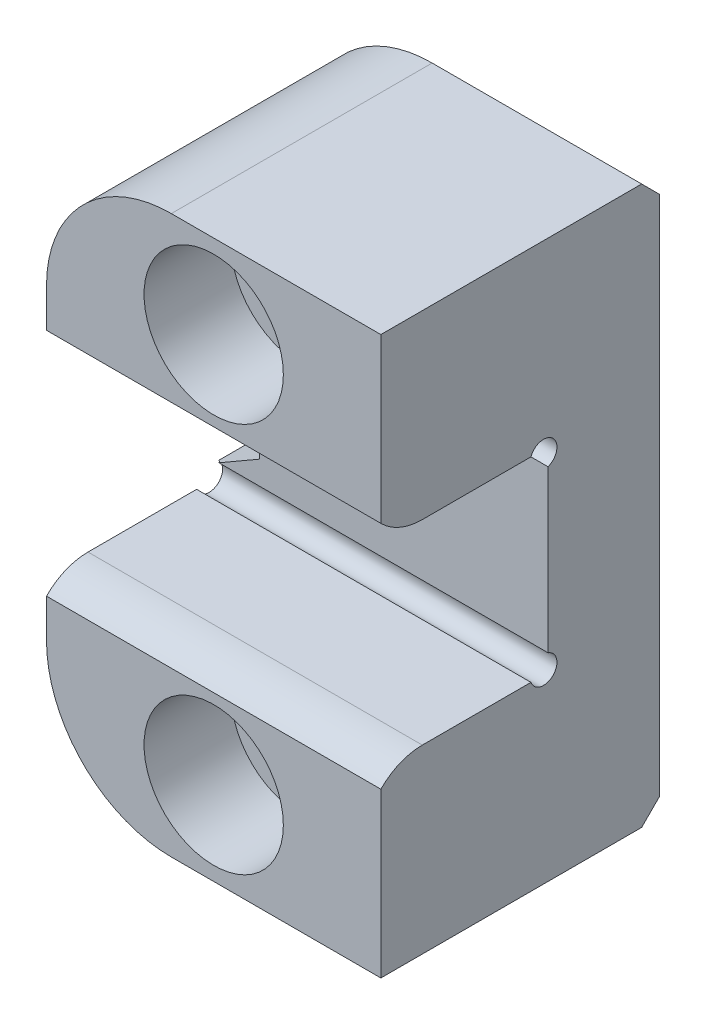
from build123d import *

# Parameters (mm, degrees)
EXTRUDE1_DEPTH        = 9.525
FILLET1_R             = 7.112
CUT_EXTRUDE1_DEPTH    = 28.49630657
CUT_EXTRUDE2_DEPTH    = 30.443738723
SKETCH6_R             = 0.762
CUT_EXTRUDE3_DEPTH    = 30.443738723
F_8_CBORE_D           = 4.9149
F_8_CBORE_CBORE_D     = 7.9375
F_8_CBORE_CBORE_DEPTH = 4.96062
CHAMFER3_SIZE         = 3.81
CHAMFER3_SIZE2        = 1.020886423
CHAMFER1_SIZE         = 1.016


with BuildPart() as part:
    # Sketch1 → Extrude1 (new, symmetric)
    with BuildSketch(Plane(origin=(0, 0, 0), x_dir=(0, 0, -1), z_dir=(1, 0, 0))):
        Polygon((0, 5.5626), (9.525, 5.5626), (9.525, -5.5626), (0, -5.5626), (0, -15.875), (15.875, -15.875), (15.875, 15.875), (0, 15.875), align=None)
    extrude(amount=EXTRUDE1_DEPTH, both=True)

    # Fillet1
    fillet1_edges = [part.edges().sort_by_distance(p)[0] for p in [
        (-9.525, 15.875, -7.9375),
        (-9.525, -15.875, -7.9375),
    ]]
    fillet(fillet1_edges, radius=FILLET1_R)

    # Sketch2 → Cut-Extrude1 (cut, through all)
    with BuildSketch(Plane(origin=(-6.35, 0, -15.875), x_dir=(1, 0, 0), z_dir=(0, 0, 1))):
        Polygon((-4.7625, 5.679043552), (-4.7625, -5.679043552), (-1.5875, -3.845956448), (-1.5875, 3.845956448), align=None)
    extrude(amount=CUT_EXTRUDE1_DEPTH, mode=Mode.SUBTRACT)

    # Sketch5 → Cut-Extrude2 (cut, through all)
    with BuildSketch(Plane(origin=(9.525, 0, 0), x_dir=(0, 0, -1), z_dir=(1, 0, 0))):
        with BuildLine():
            Line((-3.9878, -3.383619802), (2.3622, -3.383619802))
            Line((2.3622, -3.383619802), (2.3622, -5.5626))
            ThreePointArc((2.3622, -5.5626), (1.080400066, -5.82178595), (0, -6.558619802))
            Line((0, -6.558619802), (-3.9878, -6.558619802))
            Line((-3.9878, -6.558619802), (-3.9878, -3.383619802))
        make_face()
        with BuildLine():
            Line((2.3622, 3.383619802), (2.3622, 5.5626))
            ThreePointArc((2.3622, 5.5626), (1.080400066, 5.82178595), (0, 6.558619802))
            Line((0, 6.558619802), (-3.9878, 6.558619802))
            Line((-3.9878, 6.558619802), (-3.9878, 3.383619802))
            Line((-3.9878, 3.383619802), (2.3622, 3.383619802))
        make_face()
    extrude(amount=-CUT_EXTRUDE2_DEPTH, mode=Mode.SUBTRACT)

    # Sketch6 → Cut-Extrude3 (cut, through all)
    with BuildSketch(Plane(origin=(9.525, 0, 0), x_dir=(0, 0, -1), z_dir=(1, 0, 0))):
        with Locations((9.271, 5.3086)):
            Circle(SKETCH6_R)
        with Locations((9.271, -5.3086)):
            Circle(SKETCH6_R)
    extrude(amount=-CUT_EXTRUDE3_DEPTH, mode=Mode.SUBTRACT)

    # 8 CBORE (through all)
    with Locations(Plane.XY):
        with Locations((0, 11.1125), (0, -11.1125)):
            CounterBoreHole(F_8_CBORE_D / 2, F_8_CBORE_CBORE_D / 2, F_8_CBORE_CBORE_DEPTH)

    # Chamfer3
    chamfer3_edges = [part.edges().sort_by_distance(p)[0] for p in [
        (-7.9375, 0, -9.525),
    ]]
    chamfer3_side = [part.faces().sort_by_distance(p)[0] for p in [
        (-7.9375, 0, -12.7),
    ]]
    chamfer(chamfer3_edges, length=CHAMFER3_SIZE, length2=CHAMFER3_SIZE2, reference=chamfer3_side[0])

    # Chamfer1
    chamfer1_edges = [part.edges().sort_by_distance(p)[0] for p in [
        (3.556, 15.875, -15.875),
        (3.556, -15.875, -15.875),
        (-9.525, -6.76275, -15.875),
        (-7.441943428, 13.791943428, -15.875),
        (-7.441943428, -13.791943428, -15.875),
        (-9.525, 6.76275, -15.875),
    ]]
    chamfer(chamfer1_edges, length=CHAMFER1_SIZE)


solid = part.part
